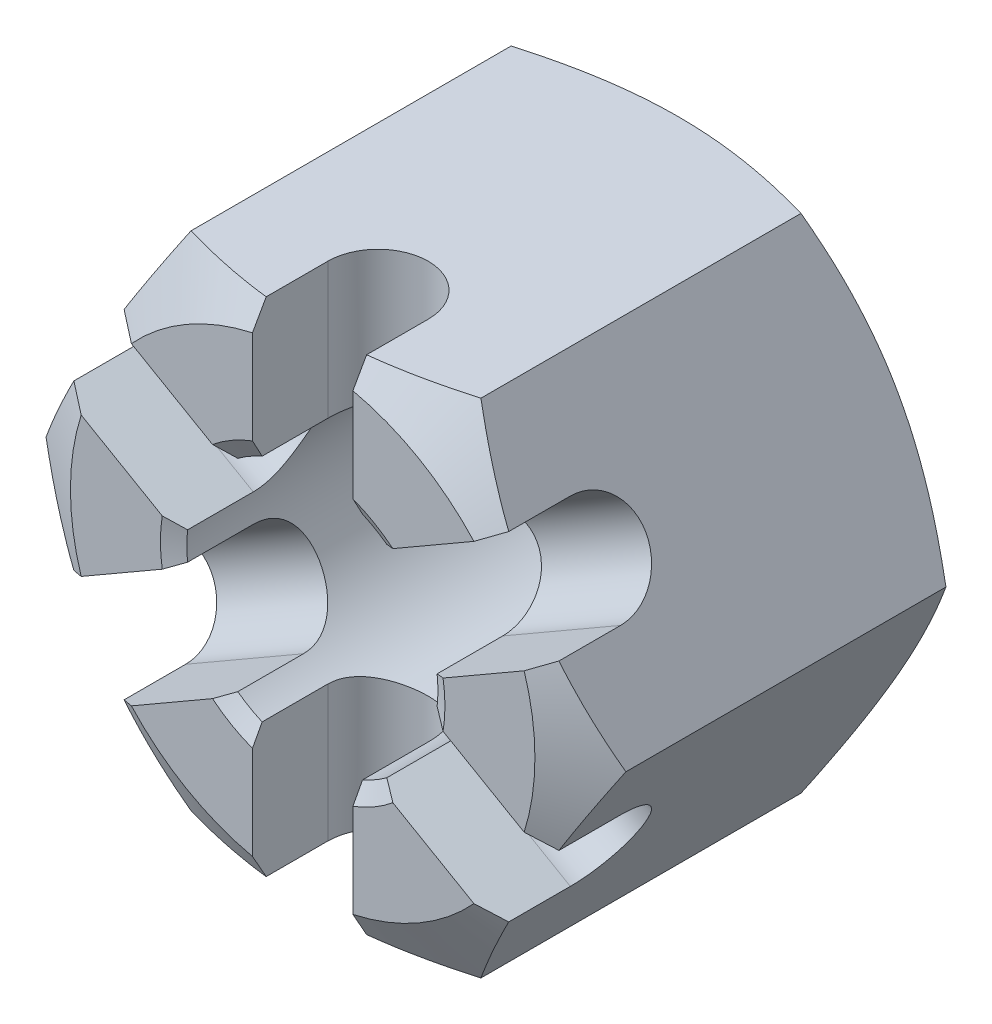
from build123d import *
from OCP.BRepFilletAPI import BRepFilletAPI_MakeChamfer

# Parameters (mm, degrees)
SKETCH1_R         = 2.5
BASENUT_DEPTH     = 7.7
ENDCHAMFER_SIZE   = 0.333333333
ENDCHAMFER_SIZE2  = 0.19245009
SLOT_DEPTH        = 11.845429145
SLOTPATTERN_COUNT = 3


with BuildPart() as part:
    # Sketch1 → BaseNut (new body)
    with BuildSketch(Plane.XY):
        Polygon((2.886751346, -5), (5.773502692, 0), (2.886751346, 5), (-2.886751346, 5), (-5.773502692, 0), (-2.886751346, -5), align=None)
        Circle(SKETCH1_R, mode=Mode.SUBTRACT)
    extrude(amount=-BASENUT_DEPTH)

    # Sketch2 → Double-Chamfer (revolve, cut)
    with BuildSketch(Plane(origin=(0, 0, 0), x_dir=(1, 0, 0), z_dir=(0, 1, 0))):
        Polygon((-5.773502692, 7.7), (-4.625, 7.7), (-5.773502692, 7.036911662), align=None)
        Polygon((-5.773502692, 0.663088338), (-5.773502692, 0), (-4.625, 0), align=None)
    revolve(axis=Axis((0, 0, -3.375940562), (0, 0, 1)), mode=Mode.SUBTRACT)

    # EndChamfer: one chamfer whose edges measure the first distance from different faces: ONE call of the kernel's chamfer builder (chamfer() names one face for all edges)
    endchamfer_edges_1 = [part.edges().sort_by_distance(p)[0] for p in [
        (-2.5, 0, -7.7),
    ]]
    endchamfer_side_1 = [part.faces().sort_by_distance(p)[0] for p in [
        (-2.5, 0, -3.85),
    ]]
    endchamfer_edges_2 = [part.edges().sort_by_distance(p)[0] for p in [
        (-2.5, 0, 0),
    ]]
    endchamfer_side_2 = [part.faces().sort_by_distance(p)[0] for p in [
        (4.494185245, 0, 0),
    ]]
    endchamfer = BRepFilletAPI_MakeChamfer(part.part.solid().wrapped)
    for e in endchamfer_edges_1:
        endchamfer.Add(ENDCHAMFER_SIZE, ENDCHAMFER_SIZE2, e.wrapped, endchamfer_side_1[0].wrapped)  # the first distance lies on this face
    for e in endchamfer_edges_2:
        endchamfer.Add(ENDCHAMFER_SIZE, ENDCHAMFER_SIZE2, e.wrapped, endchamfer_side_2[0].wrapped)  # the first distance lies on this face
    add(Compound.cast(endchamfer.Shape()), mode=Mode.REPLACE)

    # Sketch3 → Slot (cut, symmetric)
    with BuildSketch(Plane(origin=(0, 0, 0), x_dir=(1, 0, 0), z_dir=(0, 1, 0))):
        with BuildLine():
            Line((-1, -30.510518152), (-1, 0))
            Line((-1, 0), (-1, 1.5))
            ThreePointArc((-1, 1.5), (0, 2.5), (1, 1.5))
            Line((1, 1.5), (1, 0))
            Line((1, 0), (1, -30.510518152))
            Line((1, -30.510518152), (1, -91.531554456))
            Line((1, -91.531554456), (-1, -91.531554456))
            Line((-1, -91.531554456), (-1, -30.510518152))
        make_face()
    slot = extrude(amount=SLOT_DEPTH, both=True, mode=Mode.SUBTRACT)

    # SlotPattern: Slot ×3 about axis
    slotpattern_axis = Axis((0, 0, 9.817107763), (0, 0, -1))
    for i in range(1, SLOTPATTERN_COUNT):
        add(slot.rotate(slotpattern_axis, i * 360 / SLOTPATTERN_COUNT), mode=Mode.SUBTRACT)


solid = part.part
